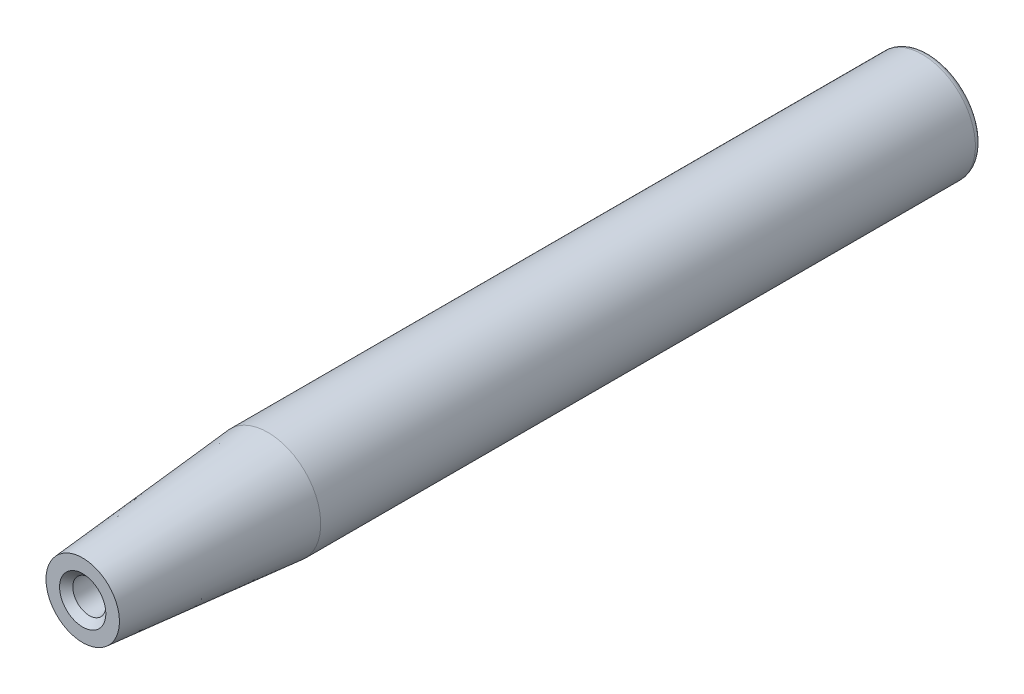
ISO-10303-21;
HEADER;
FILE_DESCRIPTION(('STEP AP214'),'2;1');
FILE_NAME('part.step','',(''),(''),'','','');
FILE_SCHEMA(('AUTOMOTIVE_DESIGN { 1 0 10303 214 1 1 1 1 }'));
ENDSEC;
DATA;
#1=APPLICATION_CONTEXT('core data for automotive mechanical design processes');
#2=APPLICATION_PROTOCOL_DEFINITION('international standard','automotive_design',2000,#1);
#3=PRODUCT_CONTEXT('',#1,'mechanical');
#4=PRODUCT('Part','Part','',(#3));
#5=PRODUCT_RELATED_PRODUCT_CATEGORY('part','',(#4));
#6=PRODUCT_DEFINITION_FORMATION('','',#4);
#7=PRODUCT_DEFINITION_CONTEXT('part definition',#1,'design');
#8=PRODUCT_DEFINITION('design','',#6,#7);
#9=PRODUCT_DEFINITION_SHAPE('','',#8);
#10=(LENGTH_UNIT() NAMED_UNIT(*) SI_UNIT(.MILLI.,.METRE.));
#11=(NAMED_UNIT(*) PLANE_ANGLE_UNIT() SI_UNIT($,.RADIAN.));
#12=(NAMED_UNIT(*) SI_UNIT($,.STERADIAN.) SOLID_ANGLE_UNIT());
#13=UNCERTAINTY_MEASURE_WITH_UNIT(LENGTH_MEASURE(1.E-05),#10,'distance_accuracy_value','');
#14=(GEOMETRIC_REPRESENTATION_CONTEXT(3) GLOBAL_UNCERTAINTY_ASSIGNED_CONTEXT((#13)) GLOBAL_UNIT_ASSIGNED_CONTEXT((#10,
#11,#12)) REPRESENTATION_CONTEXT('',''));
#15=CARTESIAN_POINT('',(0.,0.,0.));
#16=DIRECTION('',(0.,0.,1.));
#17=DIRECTION('',(1.,0.,0.));
#18=AXIS2_PLACEMENT_3D('',#15,#16,#17);
#19=CARTESIAN_POINT('',(0.,0.,-100.));
#20=DIRECTION('',(0.,0.,-1.));
#21=DIRECTION('',(-1.,0.,0.));
#22=AXIS2_PLACEMENT_3D('',#19,#20,#21);
#23=PLANE('',#22);
#24=CARTESIAN_POINT('',(0.,0.,-100.));
#25=DIRECTION('',(0.,0.,-1.));
#26=DIRECTION('',(-1.,0.,0.));
#27=AXIS2_PLACEMENT_3D('',#24,#25,#26);
#28=CIRCLE('',#27,7.);
#29=CARTESIAN_POINT('',(-7.,0.,-100.));
#30=VERTEX_POINT('',#29);
#31=EDGE_CURVE('E72',#30,#30,#28,.T.);
#32=ORIENTED_EDGE('',*,*,#31,.T.);
#33=EDGE_LOOP('',(#32));
#34=FACE_BOUND('',#33,.T.);
#35=ADVANCED_FACE('F45',(#34),#23,.T.);
#36=CARTESIAN_POINT('',(0.,0.,-103.163187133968));
#37=DIRECTION('',(0.,0.,-1.));
#38=DIRECTION('',(-1.,0.,0.));
#39=AXIS2_PLACEMENT_3D('',#36,#37,#38);
#40=CYLINDRICAL_SURFACE('',#39,8.);
#41=CARTESIAN_POINT('',(0.,0.,-99.));
#42=DIRECTION('',(0.,0.,-1.));
#43=DIRECTION('',(-1.,0.,0.));
#44=AXIS2_PLACEMENT_3D('',#41,#42,#43);
#45=CIRCLE('',#44,8.);
#46=CARTESIAN_POINT('',(-8.,0.,-99.));
#47=VERTEX_POINT('',#46);
#48=EDGE_CURVE('E75',#47,#47,#45,.F.);
#49=ORIENTED_EDGE('',*,*,#48,.T.);
#50=EDGE_LOOP('',(#49));
#51=FACE_BOUND('',#50,.T.);
#52=CARTESIAN_POINT('',(0.,0.,0.));
#53=DIRECTION('',(0.,0.,-1.));
#54=DIRECTION('',(-1.,0.,0.));
#55=AXIS2_PLACEMENT_3D('',#52,#53,#54);
#56=CIRCLE('',#55,8.);
#57=CARTESIAN_POINT('',(-7.99999999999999,0.,0.));
#58=VERTEX_POINT('',#57);
#59=EDGE_CURVE('E67',#58,#58,#56,.T.);
#60=ORIENTED_EDGE('',*,*,#59,.T.);
#61=EDGE_LOOP('',(#60));
#62=FACE_BOUND('',#61,.T.);
#63=ADVANCED_FACE('F88',(#51,#62),#40,.T.);
#64=CARTESIAN_POINT('',(0.,0.,0.));
#65=DIRECTION('',(0.,0.,-1.));
#66=DIRECTION('',(-1.,0.,0.));
#67=AXIS2_PLACEMENT_3D('',#64,#65,#66);
#68=CONICAL_SURFACE('',#67,8.,0.0872664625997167);
#69=CARTESIAN_POINT('',(0.,0.,28.));
#70=DIRECTION('',(0.,0.,-1.));
#71=DIRECTION('',(-1.,0.,0.));
#72=AXIS2_PLACEMENT_3D('',#69,#70,#71);
#73=CIRCLE('',#72,5.55031742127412);
#74=CARTESIAN_POINT('',(-5.55031742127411,0.,28.));
#75=VERTEX_POINT('',#74);
#76=EDGE_CURVE('E64',#75,#75,#73,.T.);
#77=ORIENTED_EDGE('',*,*,#76,.T.);
#78=EDGE_LOOP('',(#77));
#79=FACE_BOUND('',#78,.T.);
#80=ORIENTED_EDGE('',*,*,#59,.F.);
#81=EDGE_LOOP('',(#80));
#82=FACE_BOUND('',#81,.T.);
#83=ADVANCED_FACE('F93',(#79,#82),#68,.T.);
#84=CARTESIAN_POINT('',(-5.55031742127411,0.,28.));
#85=DIRECTION('',(0.,0.,1.));
#86=DIRECTION('',(1.,0.,0.));
#87=AXIS2_PLACEMENT_3D('',#84,#85,#86);
#88=PLANE('',#87);
#89=CARTESIAN_POINT('',(0.,0.,28.));
#90=DIRECTION('',(0.,0.,1.));
#91=DIRECTION('',(1.,0.,0.));
#92=AXIS2_PLACEMENT_3D('',#89,#90,#91);
#93=CIRCLE('',#92,3.49999999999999);
#94=CARTESIAN_POINT('',(3.49999999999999,0.,28.));
#95=VERTEX_POINT('',#94);
#96=EDGE_CURVE('E11',#95,#95,#93,.F.);
#97=ORIENTED_EDGE('',*,*,#96,.T.);
#98=EDGE_LOOP('',(#97));
#99=FACE_BOUND('',#98,.T.);
#100=ORIENTED_EDGE('',*,*,#76,.F.);
#101=EDGE_LOOP('',(#100));
#102=FACE_BOUND('',#101,.T.);
#103=ADVANCED_FACE('F99',(#99,#102),#88,.T.);
#104=CARTESIAN_POINT('',(0.,0.,-99.));
#105=DIRECTION('',(0.,0.,-1.));
#106=DIRECTION('',(-1.,0.,0.));
#107=AXIS2_PLACEMENT_3D('',#104,#105,#106);
#108=TOROIDAL_SURFACE('',#107,7.,1.);
#109=ORIENTED_EDGE('',*,*,#48,.F.);
#110=EDGE_LOOP('',(#109));
#111=FACE_BOUND('',#110,.T.);
#112=ORIENTED_EDGE('',*,*,#31,.F.);
#113=EDGE_LOOP('',(#112));
#114=FACE_BOUND('',#113,.T.);
#115=ADVANCED_FACE('F97',(#111,#114),#108,.T.);
#116=CARTESIAN_POINT('',(0.,0.,28.));
#117=DIRECTION('',(0.,0.,1.));
#118=DIRECTION('',(1.,0.,0.));
#119=AXIS2_PLACEMENT_3D('',#116,#117,#118);
#120=CYLINDRICAL_SURFACE('',#119,2.49999999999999);
#121=CARTESIAN_POINT('',(0.,0.,27.));
#122=DIRECTION('',(0.,0.,1.));
#123=DIRECTION('',(1.,0.,0.));
#124=AXIS2_PLACEMENT_3D('',#121,#122,#123);
#125=CIRCLE('',#124,2.49999999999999);
#126=CARTESIAN_POINT('',(2.49999999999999,0.,27.));
#127=VERTEX_POINT('',#126);
#128=EDGE_CURVE('E51',#127,#127,#125,.T.);
#129=ORIENTED_EDGE('',*,*,#128,.T.);
#130=EDGE_LOOP('',(#129));
#131=FACE_BOUND('',#130,.T.);
#132=CARTESIAN_POINT('',(0.,0.,11.));
#133=DIRECTION('',(0.,0.,1.));
#134=DIRECTION('',(1.,0.,0.));
#135=AXIS2_PLACEMENT_3D('',#132,#133,#134);
#136=CIRCLE('',#135,2.49999999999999);
#137=CARTESIAN_POINT('',(2.49999999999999,0.,11.));
#138=VERTEX_POINT('',#137);
#139=EDGE_CURVE('E62',#138,#138,#136,.T.);
#140=ORIENTED_EDGE('',*,*,#139,.F.);
#141=EDGE_LOOP('',(#140));
#142=FACE_BOUND('',#141,.T.);
#143=ADVANCED_FACE('F58',(#131,#142),#120,.F.);
#144=CARTESIAN_POINT('',(0.,0.,11.));
#145=DIRECTION('',(0.,0.,1.));
#146=DIRECTION('',(1.,0.,0.));
#147=AXIS2_PLACEMENT_3D('',#144,#145,#146);
#148=CONICAL_SURFACE('',#147,2.49999999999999,1.02974425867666);
#149=CARTESIAN_POINT('',(0.,0.,9.49784845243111));
#150=VERTEX_POINT('',#149);
#151=VERTEX_LOOP('',#150);
#152=FACE_BOUND('',#151,.T.);
#153=ORIENTED_EDGE('',*,*,#139,.T.);
#154=EDGE_LOOP('',(#153));
#155=FACE_BOUND('',#154,.T.);
#156=ADVANCED_FACE('F54',(#152,#155),#148,.F.);
#157=CARTESIAN_POINT('',(0.,0.,27.));
#158=DIRECTION('',(0.,0.,1.));
#159=DIRECTION('',(1.,0.,0.));
#160=AXIS2_PLACEMENT_3D('',#157,#158,#159);
#161=CONICAL_SURFACE('',#160,2.49999999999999,0.78539816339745);
#162=ORIENTED_EDGE('',*,*,#96,.F.);
#163=EDGE_LOOP('',(#162));
#164=FACE_BOUND('',#163,.T.);
#165=ORIENTED_EDGE('',*,*,#128,.F.);
#166=EDGE_LOOP('',(#165));
#167=FACE_BOUND('',#166,.T.);
#168=ADVANCED_FACE('F57',(#164,#167),#161,.F.);
#169=CLOSED_SHELL('',(#35,#63,#83,#103,#115,#143,#156,#168));
#170=MANIFOLD_SOLID_BREP('B2',#169);
#171=ADVANCED_BREP_SHAPE_REPRESENTATION('',(#18,#170),#14);
#172=SHAPE_DEFINITION_REPRESENTATION(#9,#171);
ENDSEC;
END-ISO-10303-21;
